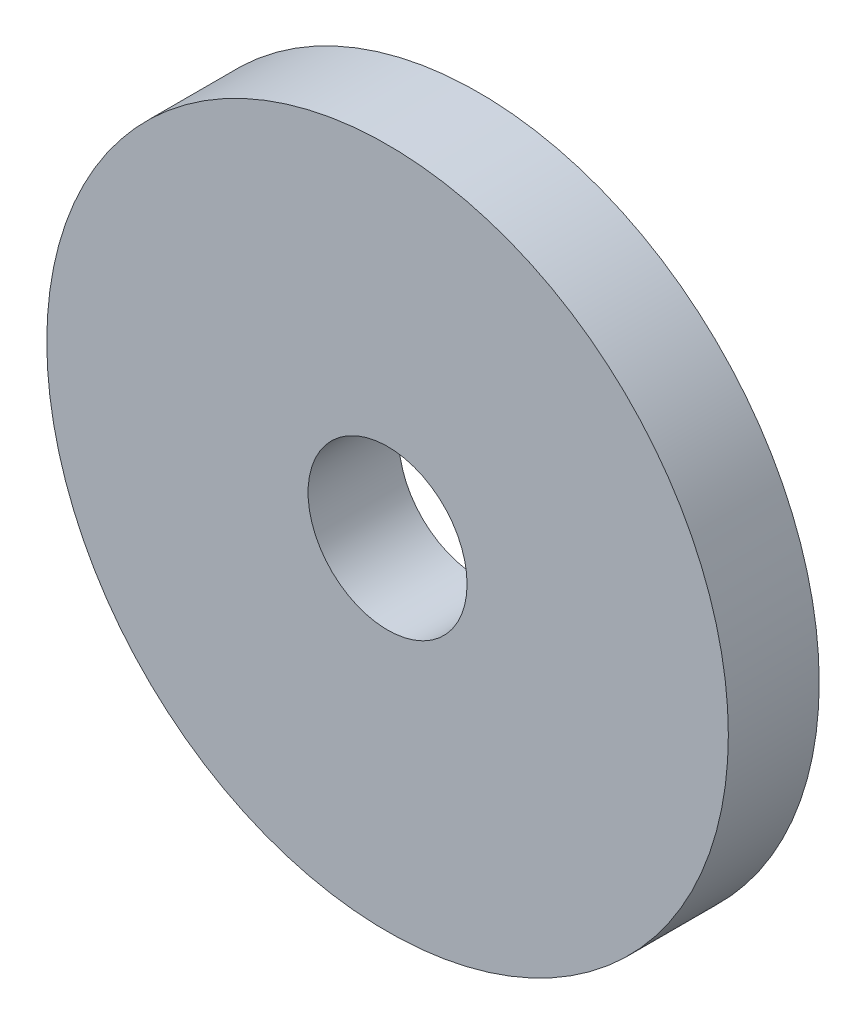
ISO-10303-21;
HEADER;
FILE_DESCRIPTION(('STEP AP214'),'2;1');
FILE_NAME('part.step','',(''),(''),'','','');
FILE_SCHEMA(('AUTOMOTIVE_DESIGN { 1 0 10303 214 1 1 1 1 }'));
ENDSEC;
DATA;
#1=APPLICATION_CONTEXT('core data for automotive mechanical design processes');
#2=APPLICATION_PROTOCOL_DEFINITION('international standard','automotive_design',2000,#1);
#3=PRODUCT_CONTEXT('',#1,'mechanical');
#4=PRODUCT('Part','Part','',(#3));
#5=PRODUCT_RELATED_PRODUCT_CATEGORY('part','',(#4));
#6=PRODUCT_DEFINITION_FORMATION('','',#4);
#7=PRODUCT_DEFINITION_CONTEXT('part definition',#1,'design');
#8=PRODUCT_DEFINITION('design','',#6,#7);
#9=PRODUCT_DEFINITION_SHAPE('','',#8);
#10=(LENGTH_UNIT() NAMED_UNIT(*) SI_UNIT(.MILLI.,.METRE.));
#11=(NAMED_UNIT(*) PLANE_ANGLE_UNIT() SI_UNIT($,.RADIAN.));
#12=(NAMED_UNIT(*) SI_UNIT($,.STERADIAN.) SOLID_ANGLE_UNIT());
#13=UNCERTAINTY_MEASURE_WITH_UNIT(LENGTH_MEASURE(1.E-05),#10,'distance_accuracy_value','');
#14=(GEOMETRIC_REPRESENTATION_CONTEXT(3) GLOBAL_UNCERTAINTY_ASSIGNED_CONTEXT((#13)) GLOBAL_UNIT_ASSIGNED_CONTEXT((#10,
#11,#12)) REPRESENTATION_CONTEXT('',''));
#15=CARTESIAN_POINT('',(0.,0.,0.));
#16=DIRECTION('',(0.,0.,1.));
#17=DIRECTION('',(1.,0.,0.));
#18=AXIS2_PLACEMENT_3D('',#15,#16,#17);
#19=CARTESIAN_POINT('',(0.,0.,2.));
#20=DIRECTION('',(0.,0.,1.));
#21=DIRECTION('',(1.,0.,0.));
#22=AXIS2_PLACEMENT_3D('',#19,#20,#21);
#23=PLANE('',#22);
#24=CARTESIAN_POINT('',(0.,0.,2.));
#25=DIRECTION('',(0.,0.,1.));
#26=DIRECTION('',(1.,0.,0.));
#27=AXIS2_PLACEMENT_3D('',#24,#25,#26);
#28=CIRCLE('',#27,7.5);
#29=CARTESIAN_POINT('',(7.5,0.,2.));
#30=VERTEX_POINT('',#29);
#31=EDGE_CURVE('E10',#30,#30,#28,.T.);
#32=ORIENTED_EDGE('',*,*,#31,.T.);
#33=EDGE_LOOP('',(#32));
#34=FACE_BOUND('',#33,.T.);
#35=CARTESIAN_POINT('',(0.,0.,2.));
#36=DIRECTION('',(0.,0.,1.));
#37=DIRECTION('',(1.,0.,0.));
#38=AXIS2_PLACEMENT_3D('',#35,#36,#37);
#39=CIRCLE('',#38,1.75);
#40=CARTESIAN_POINT('',(1.75,0.,2.));
#41=VERTEX_POINT('',#40);
#42=EDGE_CURVE('E41',#41,#41,#39,.T.);
#43=ORIENTED_EDGE('',*,*,#42,.F.);
#44=EDGE_LOOP('',(#43));
#45=FACE_BOUND('',#44,.T.);
#46=ADVANCED_FACE('F30',(#34,#45),#23,.T.);
#47=CARTESIAN_POINT('',(0.,0.,0.));
#48=DIRECTION('',(0.,0.,1.));
#49=DIRECTION('',(1.,0.,0.));
#50=AXIS2_PLACEMENT_3D('',#47,#48,#49);
#51=PLANE('',#50);
#52=CARTESIAN_POINT('',(0.,0.,0.));
#53=DIRECTION('',(0.,0.,1.));
#54=DIRECTION('',(1.,0.,0.));
#55=AXIS2_PLACEMENT_3D('',#52,#53,#54);
#56=CIRCLE('',#55,7.5);
#57=CARTESIAN_POINT('',(7.5,0.,0.));
#58=VERTEX_POINT('',#57);
#59=EDGE_CURVE('E34',#58,#58,#56,.T.);
#60=ORIENTED_EDGE('',*,*,#59,.F.);
#61=EDGE_LOOP('',(#60));
#62=FACE_BOUND('',#61,.T.);
#63=CARTESIAN_POINT('',(0.,0.,0.));
#64=DIRECTION('',(0.,0.,1.));
#65=DIRECTION('',(1.,0.,0.));
#66=AXIS2_PLACEMENT_3D('',#63,#64,#65);
#67=CIRCLE('',#66,1.75);
#68=CARTESIAN_POINT('',(1.75,0.,0.));
#69=VERTEX_POINT('',#68);
#70=EDGE_CURVE('E43',#69,#69,#67,.T.);
#71=ORIENTED_EDGE('',*,*,#70,.T.);
#72=EDGE_LOOP('',(#71));
#73=FACE_BOUND('',#72,.T.);
#74=ADVANCED_FACE('F53',(#62,#73),#51,.F.);
#75=CARTESIAN_POINT('',(0.,0.,2.));
#76=DIRECTION('',(0.,0.,-1.));
#77=DIRECTION('',(-1.,0.,0.));
#78=AXIS2_PLACEMENT_3D('',#75,#76,#77);
#79=CYLINDRICAL_SURFACE('',#78,7.5);
#80=ORIENTED_EDGE('',*,*,#31,.F.);
#81=EDGE_LOOP('',(#80));
#82=FACE_BOUND('',#81,.T.);
#83=ORIENTED_EDGE('',*,*,#59,.T.);
#84=EDGE_LOOP('',(#83));
#85=FACE_BOUND('',#84,.T.);
#86=ADVANCED_FACE('F32',(#82,#85),#79,.T.);
#87=CARTESIAN_POINT('',(0.,0.,2.));
#88=DIRECTION('',(0.,0.,-1.));
#89=DIRECTION('',(-1.,0.,0.));
#90=AXIS2_PLACEMENT_3D('',#87,#88,#89);
#91=CYLINDRICAL_SURFACE('',#90,1.75);
#92=ORIENTED_EDGE('',*,*,#42,.T.);
#93=EDGE_LOOP('',(#92));
#94=FACE_BOUND('',#93,.T.);
#95=ORIENTED_EDGE('',*,*,#70,.F.);
#96=EDGE_LOOP('',(#95));
#97=FACE_BOUND('',#96,.T.);
#98=ADVANCED_FACE('F49',(#94,#97),#91,.F.);
#99=CLOSED_SHELL('',(#46,#74,#86,#98));
#100=MANIFOLD_SOLID_BREP('B2',#99);
#101=ADVANCED_BREP_SHAPE_REPRESENTATION('',(#18,#100),#14);
#102=SHAPE_DEFINITION_REPRESENTATION(#9,#101);
ENDSEC;
END-ISO-10303-21;
